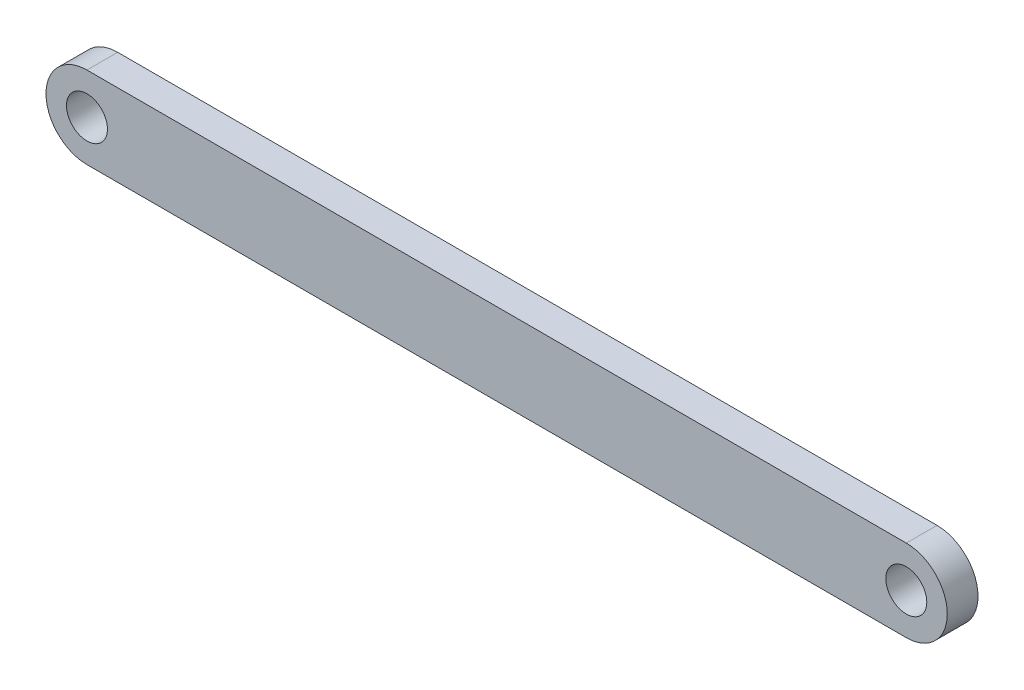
ISO-10303-21;
HEADER;
FILE_DESCRIPTION(('STEP AP214'),'2;1');
FILE_NAME('part.step','',(''),(''),'','','');
FILE_SCHEMA(('AUTOMOTIVE_DESIGN { 1 0 10303 214 1 1 1 1 }'));
ENDSEC;
DATA;
#1=APPLICATION_CONTEXT('core data for automotive mechanical design processes');
#2=APPLICATION_PROTOCOL_DEFINITION('international standard','automotive_design',2000,#1);
#3=PRODUCT_CONTEXT('',#1,'mechanical');
#4=PRODUCT('Part','Part','',(#3));
#5=PRODUCT_RELATED_PRODUCT_CATEGORY('part','',(#4));
#6=PRODUCT_DEFINITION_FORMATION('','',#4);
#7=PRODUCT_DEFINITION_CONTEXT('part definition',#1,'design');
#8=PRODUCT_DEFINITION('design','',#6,#7);
#9=PRODUCT_DEFINITION_SHAPE('','',#8);
#10=(LENGTH_UNIT() NAMED_UNIT(*) SI_UNIT(.MILLI.,.METRE.));
#11=(NAMED_UNIT(*) PLANE_ANGLE_UNIT() SI_UNIT($,.RADIAN.));
#12=(NAMED_UNIT(*) SI_UNIT($,.STERADIAN.) SOLID_ANGLE_UNIT());
#13=UNCERTAINTY_MEASURE_WITH_UNIT(LENGTH_MEASURE(1.E-05),#10,'distance_accuracy_value','');
#14=(GEOMETRIC_REPRESENTATION_CONTEXT(3) GLOBAL_UNCERTAINTY_ASSIGNED_CONTEXT((#13)) GLOBAL_UNIT_ASSIGNED_CONTEXT((#10,
#11,#12)) REPRESENTATION_CONTEXT('',''));
#15=CARTESIAN_POINT('',(0.,0.,0.));
#16=DIRECTION('',(0.,0.,1.));
#17=DIRECTION('',(1.,0.,0.));
#18=AXIS2_PLACEMENT_3D('',#15,#16,#17);
#19=CARTESIAN_POINT('',(-65.045038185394,-11.5842044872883,0.));
#20=DIRECTION('',(0.,0.,1.));
#21=DIRECTION('',(1.,0.,0.));
#22=AXIS2_PLACEMENT_3D('',#19,#20,#21);
#23=PLANE('',#22);
#24=CARTESIAN_POINT('',(14.954961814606,-11.5842044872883,0.));
#25=DIRECTION('',(0.,0.,1.));
#26=DIRECTION('',(1.,0.,0.));
#27=AXIS2_PLACEMENT_3D('',#24,#25,#26);
#28=CIRCLE('',#27,2.);
#29=CARTESIAN_POINT('',(16.954961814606,-11.5842044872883,0.));
#30=VERTEX_POINT('',#29);
#31=EDGE_CURVE('E127',#30,#30,#28,.T.);
#32=ORIENTED_EDGE('',*,*,#31,.T.);
#33=EDGE_LOOP('',(#32));
#34=FACE_BOUND('',#33,.T.);
#35=CARTESIAN_POINT('',(-65.045038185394,-11.5842044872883,0.));
#36=DIRECTION('',(0.,0.,1.));
#37=DIRECTION('',(1.,0.,0.));
#38=AXIS2_PLACEMENT_3D('',#35,#36,#37);
#39=CIRCLE('',#38,2.);
#40=CARTESIAN_POINT('',(-63.045038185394,-11.5842044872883,0.));
#41=VERTEX_POINT('',#40);
#42=EDGE_CURVE('E83',#41,#41,#39,.T.);
#43=ORIENTED_EDGE('',*,*,#42,.T.);
#44=EDGE_LOOP('',(#43));
#45=FACE_BOUND('',#44,.T.);
#46=DIRECTION('',(1.,0.,0.));
#47=VECTOR('',#46,1.);
#48=CARTESIAN_POINT('',(-65.045038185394,-7.58420448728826,0.));
#49=LINE('',#48,#47);
#50=CARTESIAN_POINT('',(-65.045038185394,-7.58420448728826,0.));
#51=VERTEX_POINT('',#50);
#52=CARTESIAN_POINT('',(14.954961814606,-7.58420448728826,0.));
#53=VERTEX_POINT('',#52);
#54=EDGE_CURVE('E77',#51,#53,#49,.T.);
#55=ORIENTED_EDGE('',*,*,#54,.T.);
#56=CARTESIAN_POINT('',(14.954961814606,-11.5842044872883,0.));
#57=DIRECTION('',(0.,0.,-1.));
#58=DIRECTION('',(-1.,0.,0.));
#59=AXIS2_PLACEMENT_3D('',#56,#57,#58);
#60=CIRCLE('',#59,4.);
#61=CARTESIAN_POINT('',(14.954961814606,-15.5842044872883,0.));
#62=VERTEX_POINT('',#61);
#63=EDGE_CURVE('E100',#62,#53,#60,.F.);
#64=ORIENTED_EDGE('',*,*,#63,.F.);
#65=DIRECTION('',(1.,0.,0.));
#66=VECTOR('',#65,1.);
#67=CARTESIAN_POINT('',(-65.045038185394,-15.5842044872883,0.));
#68=LINE('',#67,#66);
#69=CARTESIAN_POINT('',(-65.045038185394,-15.5842044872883,0.));
#70=VERTEX_POINT('',#69);
#71=EDGE_CURVE('E98',#62,#70,#68,.F.);
#72=ORIENTED_EDGE('',*,*,#71,.T.);
#73=CARTESIAN_POINT('',(-65.045038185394,-11.5842044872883,0.));
#74=DIRECTION('',(0.,0.,-1.));
#75=DIRECTION('',(-1.,0.,0.));
#76=AXIS2_PLACEMENT_3D('',#73,#74,#75);
#77=CIRCLE('',#76,4.);
#78=CARTESIAN_POINT('',(-69.045038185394,-11.5842044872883,0.));
#79=VERTEX_POINT('',#78);
#80=EDGE_CURVE('E79',#79,#70,#77,.F.);
#81=ORIENTED_EDGE('',*,*,#80,.F.);
#82=CARTESIAN_POINT('',(-65.045038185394,-11.5842044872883,0.));
#83=DIRECTION('',(0.,0.,-1.));
#84=DIRECTION('',(-1.,0.,0.));
#85=AXIS2_PLACEMENT_3D('',#82,#83,#84);
#86=CIRCLE('',#85,4.);
#87=EDGE_CURVE('E33',#51,#79,#86,.F.);
#88=ORIENTED_EDGE('',*,*,#87,.F.);
#89=EDGE_LOOP('',(#55,#64,#72,#81,#88));
#90=FACE_BOUND('',#89,.T.);
#91=ADVANCED_FACE('F30',(#34,#45,#90),#23,.F.);
#92=CARTESIAN_POINT('',(-65.045038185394,-11.5842044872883,3.));
#93=DIRECTION('',(0.,0.,-1.));
#94=DIRECTION('',(-1.,0.,0.));
#95=AXIS2_PLACEMENT_3D('',#92,#93,#94);
#96=CYLINDRICAL_SURFACE('',#95,4.);
#97=DIRECTION('',(0.,0.,-1.));
#98=VECTOR('',#97,1.);
#99=CARTESIAN_POINT('',(-65.045038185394,-7.58420448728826,3.));
#100=LINE('',#99,#98);
#101=CARTESIAN_POINT('',(-65.045038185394,-7.58420448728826,3.));
#102=VERTEX_POINT('',#101);
#103=EDGE_CURVE('E85',#102,#51,#100,.T.);
#104=ORIENTED_EDGE('',*,*,#103,.T.);
#105=ORIENTED_EDGE('',*,*,#87,.T.);
#106=DIRECTION('',(0.,0.,-1.));
#107=VECTOR('',#106,1.);
#108=CARTESIAN_POINT('',(-69.045038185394,-11.5842044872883,3.));
#109=LINE('',#108,#107);
#110=CARTESIAN_POINT('',(-69.045038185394,-11.5842044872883,3.));
#111=VERTEX_POINT('',#110);
#112=EDGE_CURVE('E82',#111,#79,#109,.T.);
#113=ORIENTED_EDGE('',*,*,#112,.F.);
#114=CARTESIAN_POINT('',(-65.045038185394,-11.5842044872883,3.));
#115=DIRECTION('',(0.,0.,-1.));
#116=DIRECTION('',(-1.,0.,0.));
#117=AXIS2_PLACEMENT_3D('',#114,#115,#116);
#118=CIRCLE('',#117,4.);
#119=EDGE_CURVE('E88',#102,#111,#118,.F.);
#120=ORIENTED_EDGE('',*,*,#119,.F.);
#121=EDGE_LOOP('',(#104,#105,#113,#120));
#122=FACE_BOUND('',#121,.T.);
#123=ADVANCED_FACE('F86',(#122),#96,.T.);
#124=CARTESIAN_POINT('',(-65.045038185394,-11.5842044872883,3.));
#125=DIRECTION('',(0.,0.,-1.));
#126=DIRECTION('',(-1.,0.,0.));
#127=AXIS2_PLACEMENT_3D('',#124,#125,#126);
#128=CYLINDRICAL_SURFACE('',#127,4.);
#129=ORIENTED_EDGE('',*,*,#80,.T.);
#130=DIRECTION('',(0.,0.,1.));
#131=VECTOR('',#130,1.);
#132=CARTESIAN_POINT('',(-65.045038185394,-15.5842044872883,3.));
#133=LINE('',#132,#131);
#134=CARTESIAN_POINT('',(-65.045038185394,-15.5842044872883,3.));
#135=VERTEX_POINT('',#134);
#136=EDGE_CURVE('E101',#70,#135,#133,.T.);
#137=ORIENTED_EDGE('',*,*,#136,.T.);
#138=CARTESIAN_POINT('',(-65.045038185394,-11.5842044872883,3.));
#139=DIRECTION('',(0.,0.,-1.));
#140=DIRECTION('',(-1.,0.,0.));
#141=AXIS2_PLACEMENT_3D('',#138,#139,#140);
#142=CIRCLE('',#141,4.);
#143=EDGE_CURVE('E93',#111,#135,#142,.F.);
#144=ORIENTED_EDGE('',*,*,#143,.F.);
#145=ORIENTED_EDGE('',*,*,#112,.T.);
#146=EDGE_LOOP('',(#129,#137,#144,#145));
#147=FACE_BOUND('',#146,.T.);
#148=ADVANCED_FACE('F110',(#147),#128,.T.);
#149=CARTESIAN_POINT('',(-65.045038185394,-15.5842044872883,3.));
#150=DIRECTION('',(0.,1.,0.));
#151=DIRECTION('',(0.,0.,1.));
#152=AXIS2_PLACEMENT_3D('',#149,#150,#151);
#153=PLANE('',#152);
#154=DIRECTION('',(0.,0.,-1.));
#155=VECTOR('',#154,1.);
#156=CARTESIAN_POINT('',(14.954961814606,-15.5842044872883,3.));
#157=LINE('',#156,#155);
#158=CARTESIAN_POINT('',(14.954961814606,-15.5842044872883,3.));
#159=VERTEX_POINT('',#158);
#160=EDGE_CURVE('E107',#159,#62,#157,.T.);
#161=ORIENTED_EDGE('',*,*,#160,.F.);
#162=DIRECTION('',(1.,0.,0.));
#163=VECTOR('',#162,1.);
#164=CARTESIAN_POINT('',(-65.045038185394,-15.5842044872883,3.));
#165=LINE('',#164,#163);
#166=EDGE_CURVE('E104',#135,#159,#165,.T.);
#167=ORIENTED_EDGE('',*,*,#166,.F.);
#168=ORIENTED_EDGE('',*,*,#136,.F.);
#169=ORIENTED_EDGE('',*,*,#71,.F.);
#170=EDGE_LOOP('',(#161,#167,#168,#169));
#171=FACE_BOUND('',#170,.T.);
#172=ADVANCED_FACE('F163',(#171),#153,.F.);
#173=CARTESIAN_POINT('',(14.954961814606,-11.5842044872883,3.));
#174=DIRECTION('',(0.,0.,-1.));
#175=DIRECTION('',(-1.,0.,0.));
#176=AXIS2_PLACEMENT_3D('',#173,#174,#175);
#177=CYLINDRICAL_SURFACE('',#176,4.);
#178=CARTESIAN_POINT('',(14.954961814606,-11.5842044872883,3.));
#179=DIRECTION('',(0.,0.,-1.));
#180=DIRECTION('',(-1.,0.,0.));
#181=AXIS2_PLACEMENT_3D('',#178,#179,#180);
#182=CIRCLE('',#181,4.);
#183=CARTESIAN_POINT('',(14.954961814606,-7.58420448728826,3.));
#184=VERTEX_POINT('',#183);
#185=EDGE_CURVE('E39',#159,#184,#182,.F.);
#186=ORIENTED_EDGE('',*,*,#185,.F.);
#187=ORIENTED_EDGE('',*,*,#160,.T.);
#188=ORIENTED_EDGE('',*,*,#63,.T.);
#189=DIRECTION('',(0.,0.,-1.));
#190=VECTOR('',#189,1.);
#191=CARTESIAN_POINT('',(14.954961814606,-7.58420448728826,3.));
#192=LINE('',#191,#190);
#193=EDGE_CURVE('E48',#53,#184,#192,.F.);
#194=ORIENTED_EDGE('',*,*,#193,.T.);
#195=EDGE_LOOP('',(#186,#187,#188,#194));
#196=FACE_BOUND('',#195,.T.);
#197=ADVANCED_FACE('F117',(#196),#177,.T.);
#198=CARTESIAN_POINT('',(-65.045038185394,-7.58420448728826,3.));
#199=DIRECTION('',(0.,-1.,0.));
#200=DIRECTION('',(0.,0.,-1.));
#201=AXIS2_PLACEMENT_3D('',#198,#199,#200);
#202=PLANE('',#201);
#203=ORIENTED_EDGE('',*,*,#103,.F.);
#204=DIRECTION('',(1.,0.,0.));
#205=VECTOR('',#204,1.);
#206=CARTESIAN_POINT('',(-65.045038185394,-7.58420448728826,3.));
#207=LINE('',#206,#205);
#208=EDGE_CURVE('E11',#184,#102,#207,.F.);
#209=ORIENTED_EDGE('',*,*,#208,.F.);
#210=ORIENTED_EDGE('',*,*,#193,.F.);
#211=ORIENTED_EDGE('',*,*,#54,.F.);
#212=EDGE_LOOP('',(#203,#209,#210,#211));
#213=FACE_BOUND('',#212,.T.);
#214=ADVANCED_FACE('F91',(#213),#202,.F.);
#215=CARTESIAN_POINT('',(-65.045038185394,-11.5842044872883,3.));
#216=DIRECTION('',(0.,0.,1.));
#217=DIRECTION('',(1.,0.,0.));
#218=AXIS2_PLACEMENT_3D('',#215,#216,#217);
#219=PLANE('',#218);
#220=CARTESIAN_POINT('',(14.954961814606,-11.5842044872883,3.));
#221=DIRECTION('',(0.,0.,1.));
#222=DIRECTION('',(1.,0.,0.));
#223=AXIS2_PLACEMENT_3D('',#220,#221,#222);
#224=CIRCLE('',#223,2.);
#225=CARTESIAN_POINT('',(16.954961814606,-11.5842044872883,3.));
#226=VERTEX_POINT('',#225);
#227=EDGE_CURVE('E130',#226,#226,#224,.T.);
#228=ORIENTED_EDGE('',*,*,#227,.F.);
#229=EDGE_LOOP('',(#228));
#230=FACE_BOUND('',#229,.T.);
#231=CARTESIAN_POINT('',(-65.045038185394,-11.5842044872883,3.));
#232=DIRECTION('',(0.,0.,1.));
#233=DIRECTION('',(1.,0.,0.));
#234=AXIS2_PLACEMENT_3D('',#231,#232,#233);
#235=CIRCLE('',#234,2.);
#236=CARTESIAN_POINT('',(-63.045038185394,-11.5842044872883,3.));
#237=VERTEX_POINT('',#236);
#238=EDGE_CURVE('E124',#237,#237,#235,.T.);
#239=ORIENTED_EDGE('',*,*,#238,.F.);
#240=EDGE_LOOP('',(#239));
#241=FACE_BOUND('',#240,.T.);
#242=ORIENTED_EDGE('',*,*,#185,.T.);
#243=ORIENTED_EDGE('',*,*,#208,.T.);
#244=ORIENTED_EDGE('',*,*,#119,.T.);
#245=ORIENTED_EDGE('',*,*,#143,.T.);
#246=ORIENTED_EDGE('',*,*,#166,.T.);
#247=EDGE_LOOP('',(#242,#243,#244,#245,#246));
#248=FACE_BOUND('',#247,.T.);
#249=ADVANCED_FACE('F115',(#230,#241,#248),#219,.T.);
#250=CARTESIAN_POINT('',(-65.045038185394,-11.5842044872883,0.));
#251=DIRECTION('',(0.,0.,1.));
#252=DIRECTION('',(1.,0.,0.));
#253=AXIS2_PLACEMENT_3D('',#250,#251,#252);
#254=CYLINDRICAL_SURFACE('',#253,2.);
#255=ORIENTED_EDGE('',*,*,#42,.F.);
#256=EDGE_LOOP('',(#255));
#257=FACE_BOUND('',#256,.T.);
#258=ORIENTED_EDGE('',*,*,#238,.T.);
#259=EDGE_LOOP('',(#258));
#260=FACE_BOUND('',#259,.T.);
#261=ADVANCED_FACE('F141',(#257,#260),#254,.F.);
#262=CARTESIAN_POINT('',(14.954961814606,-11.5842044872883,0.));
#263=DIRECTION('',(0.,0.,1.));
#264=DIRECTION('',(1.,0.,0.));
#265=AXIS2_PLACEMENT_3D('',#262,#263,#264);
#266=CYLINDRICAL_SURFACE('',#265,2.);
#267=ORIENTED_EDGE('',*,*,#31,.F.);
#268=EDGE_LOOP('',(#267));
#269=FACE_BOUND('',#268,.T.);
#270=ORIENTED_EDGE('',*,*,#227,.T.);
#271=EDGE_LOOP('',(#270));
#272=FACE_BOUND('',#271,.T.);
#273=ADVANCED_FACE('F138',(#269,#272),#266,.F.);
#274=CLOSED_SHELL('',(#91,#123,#148,#172,#197,#214,#249,#261,#273));
#275=MANIFOLD_SOLID_BREP('B2',#274);
#276=ADVANCED_BREP_SHAPE_REPRESENTATION('',(#18,#275),#14);
#277=SHAPE_DEFINITION_REPRESENTATION(#9,#276);
ENDSEC;
END-ISO-10303-21;
